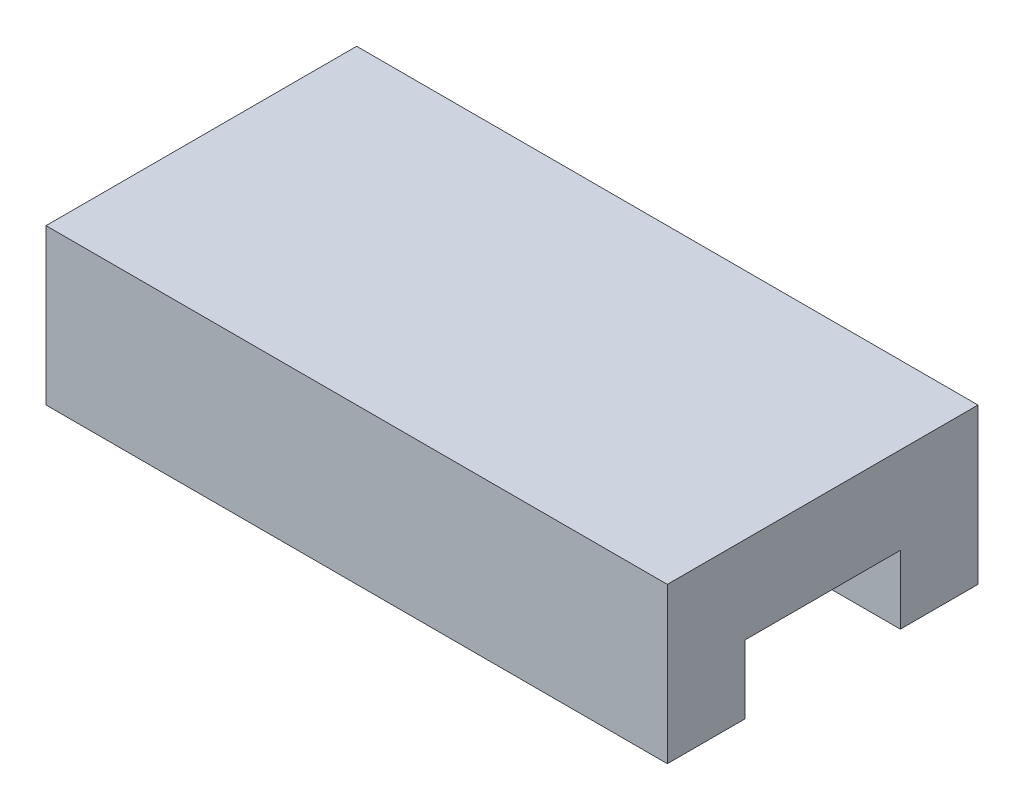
from build123d import *

# Parameters (mm, degrees)
SKETCH1_W          = 200
SKETCH1_H          = 50
EXTRUDE1_DEPTH     = 100
SKETCH2_W          = 50
SKETCH2_H          = 22
CUT_EXTRUDE1_DEPTH = 230.128784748


with BuildPart() as part:
    # Sketch1 → Extrude1 (new body)
    with BuildSketch(Plane.XY):
        with Locations((0, 25)):
            Rectangle(SKETCH1_W, SKETCH1_H)
    extrude(amount=-EXTRUDE1_DEPTH)

    # Sketch2 → Cut-Extrude1 (cut, through all)
    with BuildSketch(Plane.ZY.offset(100)):
        with Locations((-50, 11)):
            Rectangle(SKETCH2_W, SKETCH2_H)
    extrude(amount=-CUT_EXTRUDE1_DEPTH, mode=Mode.SUBTRACT)


solid = part.part
